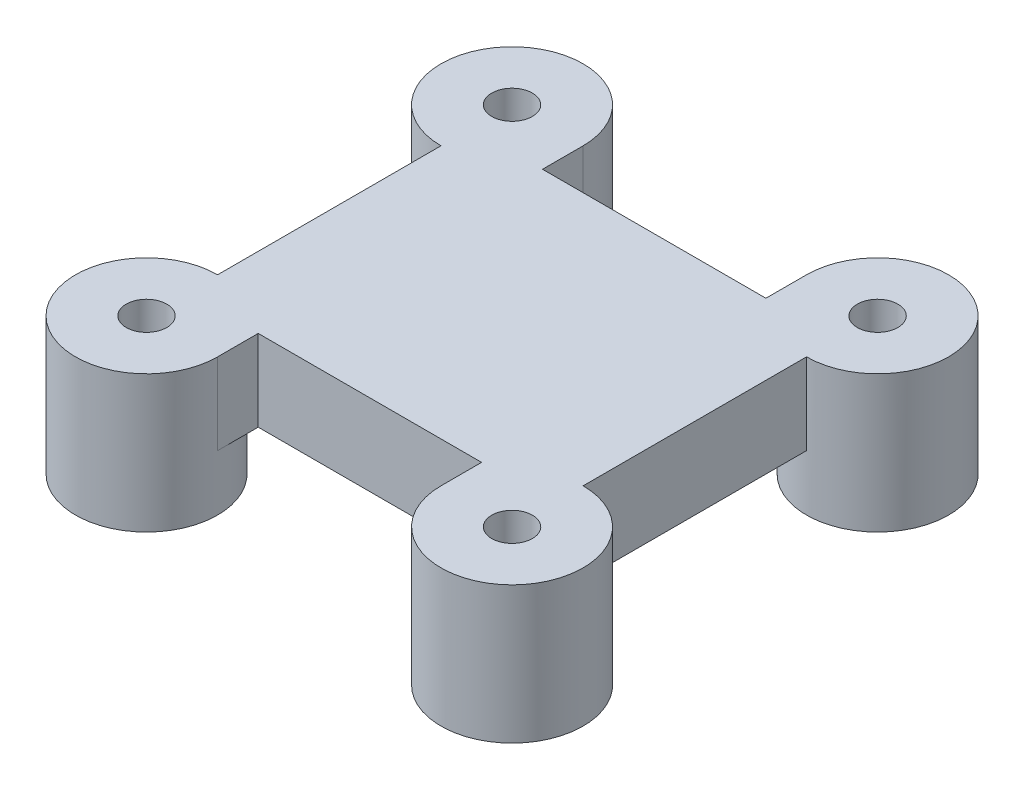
ISO-10303-21;
HEADER;
FILE_DESCRIPTION(('STEP AP214'),'2;1');
FILE_NAME('part.step','',(''),(''),'','','');
FILE_SCHEMA(('AUTOMOTIVE_DESIGN { 1 0 10303 214 1 1 1 1 }'));
ENDSEC;
DATA;
#1=APPLICATION_CONTEXT('core data for automotive mechanical design processes');
#2=APPLICATION_PROTOCOL_DEFINITION('international standard','automotive_design',2000,#1);
#3=PRODUCT_CONTEXT('',#1,'mechanical');
#4=PRODUCT('Part','Part','',(#3));
#5=PRODUCT_RELATED_PRODUCT_CATEGORY('part','',(#4));
#6=PRODUCT_DEFINITION_FORMATION('','',#4);
#7=PRODUCT_DEFINITION_CONTEXT('part definition',#1,'design');
#8=PRODUCT_DEFINITION('design','',#6,#7);
#9=PRODUCT_DEFINITION_SHAPE('','',#8);
#10=(LENGTH_UNIT() NAMED_UNIT(*) SI_UNIT(.MILLI.,.METRE.));
#11=(NAMED_UNIT(*) PLANE_ANGLE_UNIT() SI_UNIT($,.RADIAN.));
#12=(NAMED_UNIT(*) SI_UNIT($,.STERADIAN.) SOLID_ANGLE_UNIT());
#13=UNCERTAINTY_MEASURE_WITH_UNIT(LENGTH_MEASURE(1.E-05),#10,'distance_accuracy_value','');
#14=(GEOMETRIC_REPRESENTATION_CONTEXT(3) GLOBAL_UNCERTAINTY_ASSIGNED_CONTEXT((#13)) GLOBAL_UNIT_ASSIGNED_CONTEXT((#10,
#11,#12)) REPRESENTATION_CONTEXT('',''));
#15=CARTESIAN_POINT('',(0.,0.,0.));
#16=DIRECTION('',(0.,0.,1.));
#17=DIRECTION('',(1.,0.,0.));
#18=AXIS2_PLACEMENT_3D('',#15,#16,#17);
#19=CARTESIAN_POINT('',(0.,0.,0.));
#20=DIRECTION('',(0.,1.,0.));
#21=DIRECTION('',(0.,0.,1.));
#22=AXIS2_PLACEMENT_3D('',#19,#20,#21);
#23=PLANE('',#22);
#24=CARTESIAN_POINT('',(-18.,0.,-18.));
#25=DIRECTION('',(0.,-1.,0.));
#26=DIRECTION('',(0.,0.,-1.));
#27=AXIS2_PLACEMENT_3D('',#24,#25,#26);
#28=CIRCLE('',#27,7.);
#29=CARTESIAN_POINT('',(-11.,0.,-18.));
#30=VERTEX_POINT('',#29);
#31=CARTESIAN_POINT('',(-18.,0.,-11.));
#32=VERTEX_POINT('',#31);
#33=EDGE_CURVE('E211',#30,#32,#28,.T.);
#34=ORIENTED_EDGE('',*,*,#33,.F.);
#35=DIRECTION('',(0.,0.,1.));
#36=VECTOR('',#35,1.);
#37=CARTESIAN_POINT('',(-11.,0.,0.));
#38=LINE('',#37,#36);
#39=CARTESIAN_POINT('',(-11.,0.,-14.));
#40=VERTEX_POINT('',#39);
#41=EDGE_CURVE('E170',#30,#40,#38,.T.);
#42=ORIENTED_EDGE('',*,*,#41,.T.);
#43=DIRECTION('',(1.,0.,0.));
#44=VECTOR('',#43,1.);
#45=CARTESIAN_POINT('',(0.,0.,-14.));
#46=LINE('',#45,#44);
#47=CARTESIAN_POINT('',(11.,0.,-14.));
#48=VERTEX_POINT('',#47);
#49=EDGE_CURVE('E178',#40,#48,#46,.T.);
#50=ORIENTED_EDGE('',*,*,#49,.T.);
#51=DIRECTION('',(0.,0.,1.));
#52=VECTOR('',#51,1.);
#53=CARTESIAN_POINT('',(11.,0.,0.));
#54=LINE('',#53,#52);
#55=CARTESIAN_POINT('',(11.,0.,-18.));
#56=VERTEX_POINT('',#55);
#57=EDGE_CURVE('E150',#56,#48,#54,.T.);
#58=ORIENTED_EDGE('',*,*,#57,.F.);
#59=CARTESIAN_POINT('',(18.,0.,-18.));
#60=DIRECTION('',(0.,-1.,0.));
#61=DIRECTION('',(0.,0.,-1.));
#62=AXIS2_PLACEMENT_3D('',#59,#60,#61);
#63=CIRCLE('',#62,7.);
#64=CARTESIAN_POINT('',(18.,0.,-11.));
#65=VERTEX_POINT('',#64);
#66=EDGE_CURVE('E340',#65,#56,#63,.T.);
#67=ORIENTED_EDGE('',*,*,#66,.F.);
#68=DIRECTION('',(0.,0.,1.));
#69=VECTOR('',#68,1.);
#70=CARTESIAN_POINT('',(18.,0.,0.));
#71=LINE('',#70,#69);
#72=CARTESIAN_POINT('',(18.,0.,11.));
#73=VERTEX_POINT('',#72);
#74=EDGE_CURVE('E175',#65,#73,#71,.T.);
#75=ORIENTED_EDGE('',*,*,#74,.T.);
#76=CARTESIAN_POINT('',(18.,0.,18.));
#77=DIRECTION('',(0.,-1.,0.));
#78=DIRECTION('',(0.,0.,-1.));
#79=AXIS2_PLACEMENT_3D('',#76,#77,#78);
#80=CIRCLE('',#79,7.);
#81=CARTESIAN_POINT('',(11.,0.,18.));
#82=VERTEX_POINT('',#81);
#83=EDGE_CURVE('E11',#82,#73,#80,.T.);
#84=ORIENTED_EDGE('',*,*,#83,.F.);
#85=CARTESIAN_POINT('',(11.,0.,14.));
#86=VERTEX_POINT('',#85);
#87=EDGE_CURVE('E172',#86,#82,#54,.T.);
#88=ORIENTED_EDGE('',*,*,#87,.F.);
#89=DIRECTION('',(1.,0.,0.));
#90=VECTOR('',#89,1.);
#91=CARTESIAN_POINT('',(0.,0.,14.));
#92=LINE('',#91,#90);
#93=CARTESIAN_POINT('',(-11.,0.,14.));
#94=VERTEX_POINT('',#93);
#95=EDGE_CURVE('E169',#94,#86,#92,.T.);
#96=ORIENTED_EDGE('',*,*,#95,.F.);
#97=CARTESIAN_POINT('',(-11.,0.,18.));
#98=VERTEX_POINT('',#97);
#99=EDGE_CURVE('E165',#94,#98,#38,.T.);
#100=ORIENTED_EDGE('',*,*,#99,.T.);
#101=CARTESIAN_POINT('',(-18.,0.,18.));
#102=DIRECTION('',(0.,-1.,0.));
#103=DIRECTION('',(0.,0.,-1.));
#104=AXIS2_PLACEMENT_3D('',#101,#102,#103);
#105=CIRCLE('',#104,7.);
#106=CARTESIAN_POINT('',(-18.,0.,11.));
#107=VERTEX_POINT('',#106);
#108=EDGE_CURVE('E218',#107,#98,#105,.T.);
#109=ORIENTED_EDGE('',*,*,#108,.F.);
#110=DIRECTION('',(0.,0.,1.));
#111=VECTOR('',#110,1.);
#112=CARTESIAN_POINT('',(-18.,0.,0.));
#113=LINE('',#112,#111);
#114=EDGE_CURVE('E162',#32,#107,#113,.T.);
#115=ORIENTED_EDGE('',*,*,#114,.F.);
#116=EDGE_LOOP('',(#34,#42,#50,#58,#67,#75,#84,#88,#96,#100,#109,#115));
#117=FACE_BOUND('',#116,.T.);
#118=ADVANCED_FACE('F45',(#117),#23,.F.);
#119=CARTESIAN_POINT('',(-18.,8.,-18.));
#120=DIRECTION('',(0.,-1.,0.));
#121=DIRECTION('',(0.,0.,-1.));
#122=AXIS2_PLACEMENT_3D('',#119,#120,#121);
#123=CYLINDRICAL_SURFACE('',#122,7.);
#124=DIRECTION('',(0.,-1.,0.));
#125=VECTOR('',#124,1.);
#126=CARTESIAN_POINT('',(-11.,8.,-18.));
#127=LINE('',#126,#125);
#128=CARTESIAN_POINT('',(-11.,8.,-18.));
#129=VERTEX_POINT('',#128);
#130=EDGE_CURVE('E63',#129,#30,#127,.T.);
#131=ORIENTED_EDGE('',*,*,#130,.T.);
#132=ORIENTED_EDGE('',*,*,#33,.T.);
#133=DIRECTION('',(0.,-1.,0.));
#134=VECTOR('',#133,1.);
#135=CARTESIAN_POINT('',(-18.,8.,-11.));
#136=LINE('',#135,#134);
#137=CARTESIAN_POINT('',(-18.,8.,-11.));
#138=VERTEX_POINT('',#137);
#139=EDGE_CURVE('E49',#138,#32,#136,.T.);
#140=ORIENTED_EDGE('',*,*,#139,.F.);
#141=CARTESIAN_POINT('',(-18.,8.,-18.));
#142=DIRECTION('',(0.,1.,0.));
#143=DIRECTION('',(0.,0.,1.));
#144=AXIS2_PLACEMENT_3D('',#141,#142,#143);
#145=CIRCLE('',#144,7.);
#146=EDGE_CURVE('E209',#129,#138,#145,.T.);
#147=ORIENTED_EDGE('',*,*,#146,.F.);
#148=EDGE_LOOP('',(#131,#132,#140,#147));
#149=FACE_BOUND('',#148,.T.);
#150=CARTESIAN_POINT('',(-18.,-5.5,-18.));
#151=DIRECTION('',(0.,-1.,0.));
#152=DIRECTION('',(0.,0.,-1.));
#153=AXIS2_PLACEMENT_3D('',#150,#151,#152);
#154=CIRCLE('',#153,7.);
#155=CARTESIAN_POINT('',(-18.,-5.5,-25.));
#156=VERTEX_POINT('',#155);
#157=EDGE_CURVE('E215',#156,#156,#154,.T.);
#158=ORIENTED_EDGE('',*,*,#157,.F.);
#159=EDGE_LOOP('',(#158));
#160=FACE_BOUND('',#159,.T.);
#161=ADVANCED_FACE('F47',(#149,#160),#123,.T.);
#162=CARTESIAN_POINT('',(-18.,8.,0.));
#163=DIRECTION('',(1.,0.,0.));
#164=DIRECTION('',(0.,0.,-1.));
#165=AXIS2_PLACEMENT_3D('',#162,#163,#164);
#166=PLANE('',#165);
#167=ORIENTED_EDGE('',*,*,#114,.T.);
#168=DIRECTION('',(0.,-1.,0.));
#169=VECTOR('',#168,1.);
#170=CARTESIAN_POINT('',(-18.,8.,11.));
#171=LINE('',#170,#169);
#172=CARTESIAN_POINT('',(-18.,8.,11.));
#173=VERTEX_POINT('',#172);
#174=EDGE_CURVE('E199',#173,#107,#171,.T.);
#175=ORIENTED_EDGE('',*,*,#174,.F.);
#176=DIRECTION('',(0.,0.,1.));
#177=VECTOR('',#176,1.);
#178=CARTESIAN_POINT('',(-18.,8.,0.));
#179=LINE('',#178,#177);
#180=EDGE_CURVE('E106',#138,#173,#179,.T.);
#181=ORIENTED_EDGE('',*,*,#180,.F.);
#182=ORIENTED_EDGE('',*,*,#139,.T.);
#183=EDGE_LOOP('',(#167,#175,#181,#182));
#184=FACE_BOUND('',#183,.T.);
#185=ADVANCED_FACE('F205',(#184),#166,.F.);
#186=CARTESIAN_POINT('',(-18.,8.,18.));
#187=DIRECTION('',(0.,-1.,0.));
#188=DIRECTION('',(0.,0.,-1.));
#189=AXIS2_PLACEMENT_3D('',#186,#187,#188);
#190=CYLINDRICAL_SURFACE('',#189,7.);
#191=ORIENTED_EDGE('',*,*,#174,.T.);
#192=ORIENTED_EDGE('',*,*,#108,.T.);
#193=DIRECTION('',(0.,-1.,0.));
#194=VECTOR('',#193,1.);
#195=CARTESIAN_POINT('',(-11.,8.,18.));
#196=LINE('',#195,#194);
#197=CARTESIAN_POINT('',(-11.,8.,18.));
#198=VERTEX_POINT('',#197);
#199=EDGE_CURVE('E197',#198,#98,#196,.T.);
#200=ORIENTED_EDGE('',*,*,#199,.F.);
#201=CARTESIAN_POINT('',(-18.,8.,18.));
#202=DIRECTION('',(0.,1.,0.));
#203=DIRECTION('',(0.,0.,1.));
#204=AXIS2_PLACEMENT_3D('',#201,#202,#203);
#205=CIRCLE('',#204,7.);
#206=EDGE_CURVE('E246',#173,#198,#205,.T.);
#207=ORIENTED_EDGE('',*,*,#206,.F.);
#208=EDGE_LOOP('',(#191,#192,#200,#207));
#209=FACE_BOUND('',#208,.T.);
#210=CARTESIAN_POINT('',(-18.,-5.5,18.));
#211=DIRECTION('',(0.,-1.,0.));
#212=DIRECTION('',(0.,0.,-1.));
#213=AXIS2_PLACEMENT_3D('',#210,#211,#212);
#214=CIRCLE('',#213,7.);
#215=CARTESIAN_POINT('',(-18.,-5.5,11.));
#216=VERTEX_POINT('',#215);
#217=EDGE_CURVE('E224',#216,#216,#214,.T.);
#218=ORIENTED_EDGE('',*,*,#217,.F.);
#219=EDGE_LOOP('',(#218));
#220=FACE_BOUND('',#219,.T.);
#221=ADVANCED_FACE('F277',(#209,#220),#190,.T.);
#222=CARTESIAN_POINT('',(-11.,8.,0.));
#223=DIRECTION('',(1.,0.,0.));
#224=DIRECTION('',(0.,0.,-1.));
#225=AXIS2_PLACEMENT_3D('',#222,#223,#224);
#226=PLANE('',#225);
#227=ORIENTED_EDGE('',*,*,#99,.F.);
#228=DIRECTION('',(0.,-1.,0.));
#229=VECTOR('',#228,1.);
#230=CARTESIAN_POINT('',(-11.,8.,14.));
#231=LINE('',#230,#229);
#232=CARTESIAN_POINT('',(-11.,8.,14.));
#233=VERTEX_POINT('',#232);
#234=EDGE_CURVE('E195',#233,#94,#231,.T.);
#235=ORIENTED_EDGE('',*,*,#234,.F.);
#236=DIRECTION('',(0.,0.,1.));
#237=VECTOR('',#236,1.);
#238=CARTESIAN_POINT('',(-11.,8.,0.));
#239=LINE('',#238,#237);
#240=EDGE_CURVE('E158',#233,#198,#239,.T.);
#241=ORIENTED_EDGE('',*,*,#240,.T.);
#242=ORIENTED_EDGE('',*,*,#199,.T.);
#243=EDGE_LOOP('',(#227,#235,#241,#242));
#244=FACE_BOUND('',#243,.T.);
#245=ADVANCED_FACE('F276',(#244),#226,.T.);
#246=CARTESIAN_POINT('',(0.,8.,14.));
#247=DIRECTION('',(0.,0.,-1.));
#248=DIRECTION('',(-1.,0.,0.));
#249=AXIS2_PLACEMENT_3D('',#246,#247,#248);
#250=PLANE('',#249);
#251=ORIENTED_EDGE('',*,*,#95,.T.);
#252=DIRECTION('',(0.,-1.,0.));
#253=VECTOR('',#252,1.);
#254=CARTESIAN_POINT('',(11.,8.,14.));
#255=LINE('',#254,#253);
#256=CARTESIAN_POINT('',(11.,8.,14.));
#257=VERTEX_POINT('',#256);
#258=EDGE_CURVE('E192',#257,#86,#255,.T.);
#259=ORIENTED_EDGE('',*,*,#258,.F.);
#260=DIRECTION('',(1.,0.,0.));
#261=VECTOR('',#260,1.);
#262=CARTESIAN_POINT('',(0.,8.,14.));
#263=LINE('',#262,#261);
#264=EDGE_CURVE('E249',#233,#257,#263,.T.);
#265=ORIENTED_EDGE('',*,*,#264,.F.);
#266=ORIENTED_EDGE('',*,*,#234,.T.);
#267=EDGE_LOOP('',(#251,#259,#265,#266));
#268=FACE_BOUND('',#267,.T.);
#269=ADVANCED_FACE('F273',(#268),#250,.F.);
#270=CARTESIAN_POINT('',(11.,8.,0.));
#271=DIRECTION('',(1.,0.,0.));
#272=DIRECTION('',(0.,0.,-1.));
#273=AXIS2_PLACEMENT_3D('',#270,#271,#272);
#274=PLANE('',#273);
#275=ORIENTED_EDGE('',*,*,#87,.T.);
#276=DIRECTION('',(0.,-1.,0.));
#277=VECTOR('',#276,1.);
#278=CARTESIAN_POINT('',(11.,8.,18.));
#279=LINE('',#278,#277);
#280=CARTESIAN_POINT('',(11.,8.,18.));
#281=VERTEX_POINT('',#280);
#282=EDGE_CURVE('E189',#281,#82,#279,.T.);
#283=ORIENTED_EDGE('',*,*,#282,.F.);
#284=DIRECTION('',(0.,0.,1.));
#285=VECTOR('',#284,1.);
#286=CARTESIAN_POINT('',(11.,8.,0.));
#287=LINE('',#286,#285);
#288=EDGE_CURVE('E147',#257,#281,#287,.T.);
#289=ORIENTED_EDGE('',*,*,#288,.F.);
#290=ORIENTED_EDGE('',*,*,#258,.T.);
#291=EDGE_LOOP('',(#275,#283,#289,#290));
#292=FACE_BOUND('',#291,.T.);
#293=ADVANCED_FACE('F269',(#292),#274,.F.);
#294=CARTESIAN_POINT('',(18.,8.,18.));
#295=DIRECTION('',(0.,-1.,0.));
#296=DIRECTION('',(0.,0.,-1.));
#297=AXIS2_PLACEMENT_3D('',#294,#295,#296);
#298=CYLINDRICAL_SURFACE('',#297,7.);
#299=ORIENTED_EDGE('',*,*,#282,.T.);
#300=ORIENTED_EDGE('',*,*,#83,.T.);
#301=DIRECTION('',(0.,-1.,0.));
#302=VECTOR('',#301,1.);
#303=CARTESIAN_POINT('',(18.,8.,11.));
#304=LINE('',#303,#302);
#305=CARTESIAN_POINT('',(18.,8.,11.));
#306=VERTEX_POINT('',#305);
#307=EDGE_CURVE('E186',#306,#73,#304,.T.);
#308=ORIENTED_EDGE('',*,*,#307,.F.);
#309=CARTESIAN_POINT('',(18.,8.,18.));
#310=DIRECTION('',(0.,1.,0.));
#311=DIRECTION('',(0.,0.,1.));
#312=AXIS2_PLACEMENT_3D('',#309,#310,#311);
#313=CIRCLE('',#312,7.);
#314=EDGE_CURVE('E251',#281,#306,#313,.T.);
#315=ORIENTED_EDGE('',*,*,#314,.F.);
#316=EDGE_LOOP('',(#299,#300,#308,#315));
#317=FACE_BOUND('',#316,.T.);
#318=CARTESIAN_POINT('',(18.,-5.5,18.));
#319=DIRECTION('',(0.,-1.,0.));
#320=DIRECTION('',(0.,0.,-1.));
#321=AXIS2_PLACEMENT_3D('',#318,#319,#320);
#322=CIRCLE('',#321,7.);
#323=CARTESIAN_POINT('',(18.,-5.5,11.));
#324=VERTEX_POINT('',#323);
#325=EDGE_CURVE('E332',#324,#324,#322,.T.);
#326=ORIENTED_EDGE('',*,*,#325,.F.);
#327=EDGE_LOOP('',(#326));
#328=FACE_BOUND('',#327,.T.);
#329=ADVANCED_FACE('F262',(#317,#328),#298,.T.);
#330=CARTESIAN_POINT('',(18.,8.,0.));
#331=DIRECTION('',(1.,0.,0.));
#332=DIRECTION('',(0.,0.,-1.));
#333=AXIS2_PLACEMENT_3D('',#330,#331,#332);
#334=PLANE('',#333);
#335=ORIENTED_EDGE('',*,*,#74,.F.);
#336=DIRECTION('',(0.,-1.,0.));
#337=VECTOR('',#336,1.);
#338=CARTESIAN_POINT('',(18.,8.,-11.));
#339=LINE('',#338,#337);
#340=CARTESIAN_POINT('',(18.,8.,-11.));
#341=VERTEX_POINT('',#340);
#342=EDGE_CURVE('E183',#341,#65,#339,.T.);
#343=ORIENTED_EDGE('',*,*,#342,.F.);
#344=DIRECTION('',(0.,0.,1.));
#345=VECTOR('',#344,1.);
#346=CARTESIAN_POINT('',(18.,8.,0.));
#347=LINE('',#346,#345);
#348=EDGE_CURVE('E252',#341,#306,#347,.T.);
#349=ORIENTED_EDGE('',*,*,#348,.T.);
#350=ORIENTED_EDGE('',*,*,#307,.T.);
#351=EDGE_LOOP('',(#335,#343,#349,#350));
#352=FACE_BOUND('',#351,.T.);
#353=ADVANCED_FACE('F256',(#352),#334,.T.);
#354=CARTESIAN_POINT('',(18.,8.,-18.));
#355=DIRECTION('',(0.,-1.,0.));
#356=DIRECTION('',(0.,0.,-1.));
#357=AXIS2_PLACEMENT_3D('',#354,#355,#356);
#358=CYLINDRICAL_SURFACE('',#357,7.);
#359=ORIENTED_EDGE('',*,*,#342,.T.);
#360=ORIENTED_EDGE('',*,*,#66,.T.);
#361=DIRECTION('',(0.,-1.,0.));
#362=VECTOR('',#361,1.);
#363=CARTESIAN_POINT('',(11.,8.,-18.));
#364=LINE('',#363,#362);
#365=CARTESIAN_POINT('',(11.,8.,-18.));
#366=VERTEX_POINT('',#365);
#367=EDGE_CURVE('E152',#366,#56,#364,.T.);
#368=ORIENTED_EDGE('',*,*,#367,.F.);
#369=CARTESIAN_POINT('',(18.,8.,-18.));
#370=DIRECTION('',(0.,1.,0.));
#371=DIRECTION('',(0.,0.,1.));
#372=AXIS2_PLACEMENT_3D('',#369,#370,#371);
#373=CIRCLE('',#372,7.);
#374=EDGE_CURVE('E142',#341,#366,#373,.T.);
#375=ORIENTED_EDGE('',*,*,#374,.F.);
#376=EDGE_LOOP('',(#359,#360,#368,#375));
#377=FACE_BOUND('',#376,.T.);
#378=CARTESIAN_POINT('',(18.,-5.5,-18.));
#379=DIRECTION('',(0.,-1.,0.));
#380=DIRECTION('',(0.,0.,-1.));
#381=AXIS2_PLACEMENT_3D('',#378,#379,#380);
#382=CIRCLE('',#381,7.);
#383=CARTESIAN_POINT('',(18.,-5.5,-25.));
#384=VERTEX_POINT('',#383);
#385=EDGE_CURVE('E342',#384,#384,#382,.T.);
#386=ORIENTED_EDGE('',*,*,#385,.F.);
#387=EDGE_LOOP('',(#386));
#388=FACE_BOUND('',#387,.T.);
#389=ADVANCED_FACE('F359',(#377,#388),#358,.T.);
#390=ORIENTED_EDGE('',*,*,#57,.T.);
#391=DIRECTION('',(0.,-1.,0.));
#392=VECTOR('',#391,1.);
#393=CARTESIAN_POINT('',(11.,8.,-14.));
#394=LINE('',#393,#392);
#395=CARTESIAN_POINT('',(11.,8.,-14.));
#396=VERTEX_POINT('',#395);
#397=EDGE_CURVE('E94',#396,#48,#394,.T.);
#398=ORIENTED_EDGE('',*,*,#397,.F.);
#399=EDGE_CURVE('E136',#366,#396,#287,.T.);
#400=ORIENTED_EDGE('',*,*,#399,.F.);
#401=ORIENTED_EDGE('',*,*,#367,.T.);
#402=EDGE_LOOP('',(#390,#398,#400,#401));
#403=FACE_BOUND('',#402,.T.);
#404=ADVANCED_FACE('F148',(#403),#274,.F.);
#405=CARTESIAN_POINT('',(0.,8.,-14.));
#406=DIRECTION('',(0.,0.,-1.));
#407=DIRECTION('',(-1.,0.,0.));
#408=AXIS2_PLACEMENT_3D('',#405,#406,#407);
#409=PLANE('',#408);
#410=ORIENTED_EDGE('',*,*,#49,.F.);
#411=DIRECTION('',(0.,-1.,0.));
#412=VECTOR('',#411,1.);
#413=CARTESIAN_POINT('',(-11.,8.,-14.));
#414=LINE('',#413,#412);
#415=CARTESIAN_POINT('',(-11.,8.,-14.));
#416=VERTEX_POINT('',#415);
#417=EDGE_CURVE('E98',#416,#40,#414,.T.);
#418=ORIENTED_EDGE('',*,*,#417,.F.);
#419=DIRECTION('',(1.,0.,0.));
#420=VECTOR('',#419,1.);
#421=CARTESIAN_POINT('',(0.,8.,-14.));
#422=LINE('',#421,#420);
#423=EDGE_CURVE('E139',#416,#396,#422,.T.);
#424=ORIENTED_EDGE('',*,*,#423,.T.);
#425=ORIENTED_EDGE('',*,*,#397,.T.);
#426=EDGE_LOOP('',(#410,#418,#424,#425));
#427=FACE_BOUND('',#426,.T.);
#428=ADVANCED_FACE('F154',(#427),#409,.T.);
#429=ORIENTED_EDGE('',*,*,#41,.F.);
#430=ORIENTED_EDGE('',*,*,#130,.F.);
#431=EDGE_CURVE('E155',#129,#416,#239,.T.);
#432=ORIENTED_EDGE('',*,*,#431,.T.);
#433=ORIENTED_EDGE('',*,*,#417,.T.);
#434=EDGE_LOOP('',(#429,#430,#432,#433));
#435=FACE_BOUND('',#434,.T.);
#436=ADVANCED_FACE('F279',(#435),#226,.T.);
#437=CARTESIAN_POINT('',(0.,8.,0.));
#438=DIRECTION('',(0.,1.,0.));
#439=DIRECTION('',(0.,0.,1.));
#440=AXIS2_PLACEMENT_3D('',#437,#438,#439);
#441=PLANE('',#440);
#442=CARTESIAN_POINT('',(18.,8.,-18.));
#443=DIRECTION('',(0.,1.,0.));
#444=DIRECTION('',(0.,0.,1.));
#445=AXIS2_PLACEMENT_3D('',#442,#443,#444);
#446=CIRCLE('',#445,2.);
#447=CARTESIAN_POINT('',(18.,8.,-16.));
#448=VERTEX_POINT('',#447);
#449=EDGE_CURVE('E228',#448,#448,#446,.T.);
#450=ORIENTED_EDGE('',*,*,#449,.F.);
#451=EDGE_LOOP('',(#450));
#452=FACE_BOUND('',#451,.T.);
#453=CARTESIAN_POINT('',(18.,8.,18.));
#454=DIRECTION('',(0.,1.,0.));
#455=DIRECTION('',(0.,0.,1.));
#456=AXIS2_PLACEMENT_3D('',#453,#454,#455);
#457=CIRCLE('',#456,2.);
#458=CARTESIAN_POINT('',(18.,8.,20.));
#459=VERTEX_POINT('',#458);
#460=EDGE_CURVE('E237',#459,#459,#457,.T.);
#461=ORIENTED_EDGE('',*,*,#460,.F.);
#462=EDGE_LOOP('',(#461));
#463=FACE_BOUND('',#462,.T.);
#464=CARTESIAN_POINT('',(-18.,8.,18.));
#465=DIRECTION('',(0.,1.,0.));
#466=DIRECTION('',(0.,0.,1.));
#467=AXIS2_PLACEMENT_3D('',#464,#465,#466);
#468=CIRCLE('',#467,2.);
#469=CARTESIAN_POINT('',(-18.,8.,20.));
#470=VERTEX_POINT('',#469);
#471=EDGE_CURVE('E234',#470,#470,#468,.T.);
#472=ORIENTED_EDGE('',*,*,#471,.F.);
#473=EDGE_LOOP('',(#472));
#474=FACE_BOUND('',#473,.T.);
#475=CARTESIAN_POINT('',(-18.,8.,-18.));
#476=DIRECTION('',(0.,1.,0.));
#477=DIRECTION('',(0.,0.,1.));
#478=AXIS2_PLACEMENT_3D('',#475,#476,#477);
#479=CIRCLE('',#478,2.00000000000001);
#480=CARTESIAN_POINT('',(-18.,8.,-16.));
#481=VERTEX_POINT('',#480);
#482=EDGE_CURVE('E166',#481,#481,#479,.T.);
#483=ORIENTED_EDGE('',*,*,#482,.F.);
#484=EDGE_LOOP('',(#483));
#485=FACE_BOUND('',#484,.T.);
#486=ORIENTED_EDGE('',*,*,#146,.T.);
#487=ORIENTED_EDGE('',*,*,#180,.T.);
#488=ORIENTED_EDGE('',*,*,#206,.T.);
#489=ORIENTED_EDGE('',*,*,#240,.F.);
#490=ORIENTED_EDGE('',*,*,#264,.T.);
#491=ORIENTED_EDGE('',*,*,#288,.T.);
#492=ORIENTED_EDGE('',*,*,#314,.T.);
#493=ORIENTED_EDGE('',*,*,#348,.F.);
#494=ORIENTED_EDGE('',*,*,#374,.T.);
#495=ORIENTED_EDGE('',*,*,#399,.T.);
#496=ORIENTED_EDGE('',*,*,#423,.F.);
#497=ORIENTED_EDGE('',*,*,#431,.F.);
#498=EDGE_LOOP('',(#486,#487,#488,#489,#490,#491,#492,#493,#494,#495,#496,#497));
#499=FACE_BOUND('',#498,.T.);
#500=ADVANCED_FACE('F137',(#452,#463,#474,#485,#499),#441,.T.);
#501=CARTESIAN_POINT('',(-18.,0.,-18.));
#502=DIRECTION('',(0.,1.,0.));
#503=DIRECTION('',(0.,0.,1.));
#504=AXIS2_PLACEMENT_3D('',#501,#502,#503);
#505=CYLINDRICAL_SURFACE('',#504,2.00000000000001);
#506=ORIENTED_EDGE('',*,*,#482,.T.);
#507=EDGE_LOOP('',(#506));
#508=FACE_BOUND('',#507,.T.);
#509=CARTESIAN_POINT('',(-18.,-5.5,-18.));
#510=DIRECTION('',(0.,-1.,0.));
#511=DIRECTION('',(0.,0.,-1.));
#512=AXIS2_PLACEMENT_3D('',#509,#510,#511);
#513=CIRCLE('',#512,2.00000000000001);
#514=CARTESIAN_POINT('',(-18.,-5.5,-20.));
#515=VERTEX_POINT('',#514);
#516=EDGE_CURVE('E214',#515,#515,#513,.T.);
#517=ORIENTED_EDGE('',*,*,#516,.T.);
#518=EDGE_LOOP('',(#517));
#519=FACE_BOUND('',#518,.T.);
#520=ADVANCED_FACE('F286',(#508,#519),#505,.F.);
#521=CARTESIAN_POINT('',(-18.,0.,18.));
#522=DIRECTION('',(0.,1.,0.));
#523=DIRECTION('',(0.,0.,1.));
#524=AXIS2_PLACEMENT_3D('',#521,#522,#523);
#525=CYLINDRICAL_SURFACE('',#524,2.);
#526=ORIENTED_EDGE('',*,*,#471,.T.);
#527=EDGE_LOOP('',(#526));
#528=FACE_BOUND('',#527,.T.);
#529=CARTESIAN_POINT('',(-18.,-5.5,18.));
#530=DIRECTION('',(0.,-1.,0.));
#531=DIRECTION('',(0.,0.,-1.));
#532=AXIS2_PLACEMENT_3D('',#529,#530,#531);
#533=CIRCLE('',#532,2.);
#534=CARTESIAN_POINT('',(-18.,-5.5,16.));
#535=VERTEX_POINT('',#534);
#536=EDGE_CURVE('E225',#535,#535,#533,.T.);
#537=ORIENTED_EDGE('',*,*,#536,.T.);
#538=EDGE_LOOP('',(#537));
#539=FACE_BOUND('',#538,.T.);
#540=ADVANCED_FACE('F299',(#528,#539),#525,.F.);
#541=CARTESIAN_POINT('',(18.,0.,18.));
#542=DIRECTION('',(0.,1.,0.));
#543=DIRECTION('',(0.,0.,1.));
#544=AXIS2_PLACEMENT_3D('',#541,#542,#543);
#545=CYLINDRICAL_SURFACE('',#544,2.);
#546=ORIENTED_EDGE('',*,*,#460,.T.);
#547=EDGE_LOOP('',(#546));
#548=FACE_BOUND('',#547,.T.);
#549=CARTESIAN_POINT('',(18.,-5.5,18.));
#550=DIRECTION('',(0.,-1.,0.));
#551=DIRECTION('',(0.,0.,-1.));
#552=AXIS2_PLACEMENT_3D('',#549,#550,#551);
#553=CIRCLE('',#552,2.);
#554=CARTESIAN_POINT('',(18.,-5.5,16.));
#555=VERTEX_POINT('',#554);
#556=EDGE_CURVE('E231',#555,#555,#553,.T.);
#557=ORIENTED_EDGE('',*,*,#556,.T.);
#558=EDGE_LOOP('',(#557));
#559=FACE_BOUND('',#558,.T.);
#560=ADVANCED_FACE('F305',(#548,#559),#545,.F.);
#561=CARTESIAN_POINT('',(18.,0.,-18.));
#562=DIRECTION('',(0.,1.,0.));
#563=DIRECTION('',(0.,0.,1.));
#564=AXIS2_PLACEMENT_3D('',#561,#562,#563);
#565=CYLINDRICAL_SURFACE('',#564,2.);
#566=ORIENTED_EDGE('',*,*,#449,.T.);
#567=EDGE_LOOP('',(#566));
#568=FACE_BOUND('',#567,.T.);
#569=CARTESIAN_POINT('',(18.,-5.5,-18.));
#570=DIRECTION('',(0.,-1.,0.));
#571=DIRECTION('',(0.,0.,-1.));
#572=AXIS2_PLACEMENT_3D('',#569,#570,#571);
#573=CIRCLE('',#572,2.);
#574=CARTESIAN_POINT('',(18.,-5.5,-20.));
#575=VERTEX_POINT('',#574);
#576=EDGE_CURVE('E337',#575,#575,#573,.T.);
#577=ORIENTED_EDGE('',*,*,#576,.T.);
#578=EDGE_LOOP('',(#577));
#579=FACE_BOUND('',#578,.T.);
#580=ADVANCED_FACE('F301',(#568,#579),#565,.F.);
#581=CARTESIAN_POINT('',(-18.,-5.5,18.));
#582=DIRECTION('',(0.,-1.,0.));
#583=DIRECTION('',(0.,0.,-1.));
#584=AXIS2_PLACEMENT_3D('',#581,#582,#583);
#585=PLANE('',#584);
#586=ORIENTED_EDGE('',*,*,#217,.T.);
#587=EDGE_LOOP('',(#586));
#588=FACE_BOUND('',#587,.T.);
#589=ORIENTED_EDGE('',*,*,#536,.F.);
#590=EDGE_LOOP('',(#589));
#591=FACE_BOUND('',#590,.T.);
#592=ADVANCED_FACE('F304',(#588,#591),#585,.T.);
#593=CARTESIAN_POINT('',(18.,-5.5,18.));
#594=DIRECTION('',(0.,-1.,0.));
#595=DIRECTION('',(0.,0.,-1.));
#596=AXIS2_PLACEMENT_3D('',#593,#594,#595);
#597=PLANE('',#596);
#598=ORIENTED_EDGE('',*,*,#325,.T.);
#599=EDGE_LOOP('',(#598));
#600=FACE_BOUND('',#599,.T.);
#601=ORIENTED_EDGE('',*,*,#556,.F.);
#602=EDGE_LOOP('',(#601));
#603=FACE_BOUND('',#602,.T.);
#604=ADVANCED_FACE('F315',(#600,#603),#597,.T.);
#605=CARTESIAN_POINT('',(18.,-5.5,-18.));
#606=DIRECTION('',(0.,-1.,0.));
#607=DIRECTION('',(0.,0.,-1.));
#608=AXIS2_PLACEMENT_3D('',#605,#606,#607);
#609=PLANE('',#608);
#610=ORIENTED_EDGE('',*,*,#385,.T.);
#611=EDGE_LOOP('',(#610));
#612=FACE_BOUND('',#611,.T.);
#613=ORIENTED_EDGE('',*,*,#576,.F.);
#614=EDGE_LOOP('',(#613));
#615=FACE_BOUND('',#614,.T.);
#616=ADVANCED_FACE('F320',(#612,#615),#609,.T.);
#617=CARTESIAN_POINT('',(-18.,-5.5,-18.));
#618=DIRECTION('',(0.,-1.,0.));
#619=DIRECTION('',(0.,0.,-1.));
#620=AXIS2_PLACEMENT_3D('',#617,#618,#619);
#621=PLANE('',#620);
#622=ORIENTED_EDGE('',*,*,#157,.T.);
#623=EDGE_LOOP('',(#622));
#624=FACE_BOUND('',#623,.T.);
#625=ORIENTED_EDGE('',*,*,#516,.F.);
#626=EDGE_LOOP('',(#625));
#627=FACE_BOUND('',#626,.T.);
#628=ADVANCED_FACE('F317',(#624,#627),#621,.T.);
#629=CLOSED_SHELL('',(#118,#161,#185,#221,#245,#269,#293,#329,#353,#389,#404,#428,#436,#500,
#520,#540,#560,#580,#592,#604,#616,#628));
#630=MANIFOLD_SOLID_BREP('B2',#629);
#631=ADVANCED_BREP_SHAPE_REPRESENTATION('',(#18,#630),#14);
#632=SHAPE_DEFINITION_REPRESENTATION(#9,#631);
ENDSEC;
END-ISO-10303-21;
